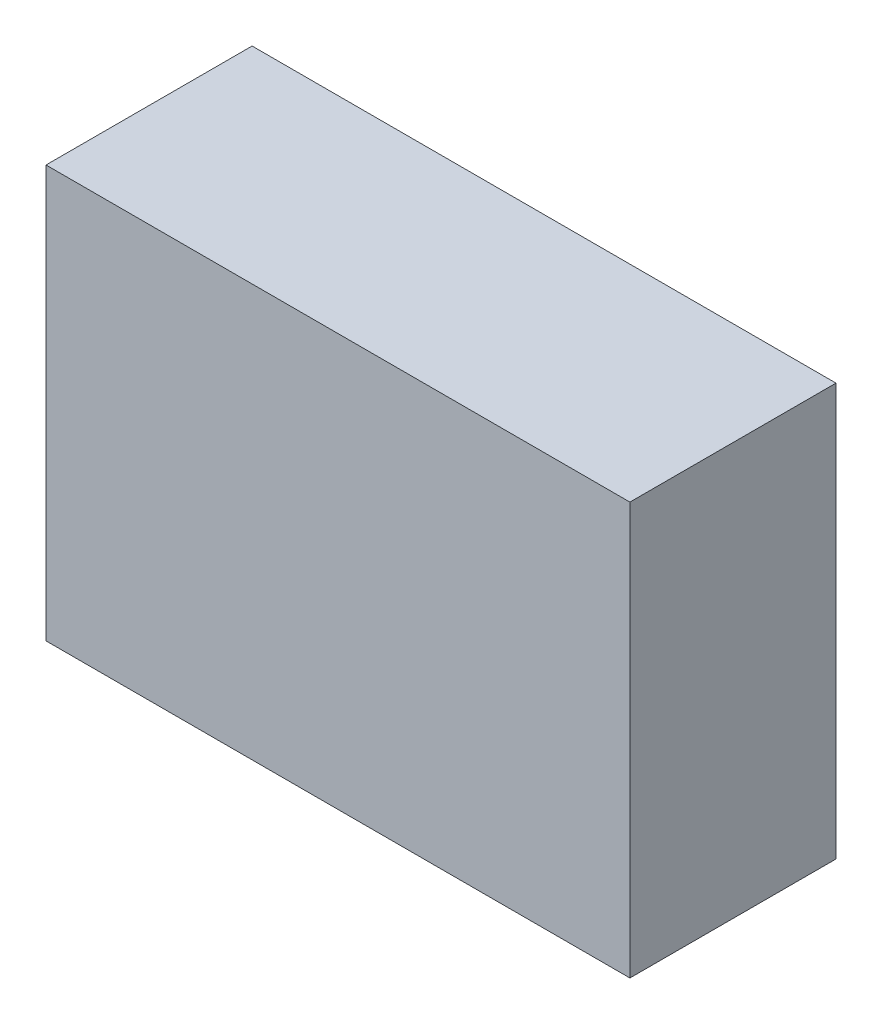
ISO-10303-21;
HEADER;
FILE_DESCRIPTION(('STEP AP214'),'2;1');
FILE_NAME('part.step','',(''),(''),'','','');
FILE_SCHEMA(('AUTOMOTIVE_DESIGN { 1 0 10303 214 1 1 1 1 }'));
ENDSEC;
DATA;
#1=APPLICATION_CONTEXT('core data for automotive mechanical design processes');
#2=APPLICATION_PROTOCOL_DEFINITION('international standard','automotive_design',2000,#1);
#3=PRODUCT_CONTEXT('',#1,'mechanical');
#4=PRODUCT('Part','Part','',(#3));
#5=PRODUCT_RELATED_PRODUCT_CATEGORY('part','',(#4));
#6=PRODUCT_DEFINITION_FORMATION('','',#4);
#7=PRODUCT_DEFINITION_CONTEXT('part definition',#1,'design');
#8=PRODUCT_DEFINITION('design','',#6,#7);
#9=PRODUCT_DEFINITION_SHAPE('','',#8);
#10=(LENGTH_UNIT() NAMED_UNIT(*) SI_UNIT(.MILLI.,.METRE.));
#11=(NAMED_UNIT(*) PLANE_ANGLE_UNIT() SI_UNIT($,.RADIAN.));
#12=(NAMED_UNIT(*) SI_UNIT($,.STERADIAN.) SOLID_ANGLE_UNIT());
#13=UNCERTAINTY_MEASURE_WITH_UNIT(LENGTH_MEASURE(1.E-05),#10,'distance_accuracy_value','');
#14=(GEOMETRIC_REPRESENTATION_CONTEXT(3) GLOBAL_UNCERTAINTY_ASSIGNED_CONTEXT((#13)) GLOBAL_UNIT_ASSIGNED_CONTEXT((#10,
#11,#12)) REPRESENTATION_CONTEXT('',''));
#15=CARTESIAN_POINT('',(0.,0.,0.));
#16=DIRECTION('',(0.,0.,1.));
#17=DIRECTION('',(1.,0.,0.));
#18=AXIS2_PLACEMENT_3D('',#15,#16,#17);
#19=CARTESIAN_POINT('',(-42.5,30.,-30.));
#20=DIRECTION('',(-1.,0.,0.));
#21=DIRECTION('',(0.,0.,1.));
#22=AXIS2_PLACEMENT_3D('',#19,#20,#21);
#23=PLANE('',#22);
#24=DIRECTION('',(0.,-1.,0.));
#25=VECTOR('',#24,1.);
#26=CARTESIAN_POINT('',(-42.5,30.,0.));
#27=LINE('',#26,#25);
#28=CARTESIAN_POINT('',(-42.5,30.,0.));
#29=VERTEX_POINT('',#28);
#30=CARTESIAN_POINT('',(-42.5,-30.,0.));
#31=VERTEX_POINT('',#30);
#32=EDGE_CURVE('E62',#29,#31,#27,.T.);
#33=ORIENTED_EDGE('',*,*,#32,.F.);
#34=DIRECTION('',(0.,0.,1.));
#35=VECTOR('',#34,1.);
#36=CARTESIAN_POINT('',(-42.5,30.,-30.));
#37=LINE('',#36,#35);
#38=CARTESIAN_POINT('',(-42.5,30.,-30.));
#39=VERTEX_POINT('',#38);
#40=EDGE_CURVE('E11',#39,#29,#37,.T.);
#41=ORIENTED_EDGE('',*,*,#40,.F.);
#42=DIRECTION('',(0.,-1.,0.));
#43=VECTOR('',#42,1.);
#44=CARTESIAN_POINT('',(-42.5,30.,-30.));
#45=LINE('',#44,#43);
#46=CARTESIAN_POINT('',(-42.5,-30.,-30.));
#47=VERTEX_POINT('',#46);
#48=EDGE_CURVE('E64',#39,#47,#45,.T.);
#49=ORIENTED_EDGE('',*,*,#48,.T.);
#50=DIRECTION('',(0.,0.,1.));
#51=VECTOR('',#50,1.);
#52=CARTESIAN_POINT('',(-42.5,-30.,-30.));
#53=LINE('',#52,#51);
#54=EDGE_CURVE('E25',#47,#31,#53,.T.);
#55=ORIENTED_EDGE('',*,*,#54,.T.);
#56=EDGE_LOOP('',(#33,#41,#49,#55));
#57=FACE_BOUND('',#56,.T.);
#58=ADVANCED_FACE('F22',(#57),#23,.T.);
#59=CARTESIAN_POINT('',(-42.5,30.,-30.));
#60=DIRECTION('',(0.,1.,0.));
#61=DIRECTION('',(0.,0.,1.));
#62=AXIS2_PLACEMENT_3D('',#59,#60,#61);
#63=PLANE('',#62);
#64=DIRECTION('',(-1.,0.,0.));
#65=VECTOR('',#64,1.);
#66=CARTESIAN_POINT('',(-42.5,30.,0.));
#67=LINE('',#66,#65);
#68=CARTESIAN_POINT('',(42.5,30.,0.));
#69=VERTEX_POINT('',#68);
#70=EDGE_CURVE('E79',#69,#29,#67,.T.);
#71=ORIENTED_EDGE('',*,*,#70,.F.);
#72=DIRECTION('',(0.,0.,1.));
#73=VECTOR('',#72,1.);
#74=CARTESIAN_POINT('',(42.5,30.,-30.));
#75=LINE('',#74,#73);
#76=CARTESIAN_POINT('',(42.5,30.,-30.));
#77=VERTEX_POINT('',#76);
#78=EDGE_CURVE('E30',#77,#69,#75,.T.);
#79=ORIENTED_EDGE('',*,*,#78,.F.);
#80=DIRECTION('',(-1.,0.,0.));
#81=VECTOR('',#80,1.);
#82=CARTESIAN_POINT('',(-42.5,30.,-30.));
#83=LINE('',#82,#81);
#84=EDGE_CURVE('E69',#77,#39,#83,.T.);
#85=ORIENTED_EDGE('',*,*,#84,.T.);
#86=ORIENTED_EDGE('',*,*,#40,.T.);
#87=EDGE_LOOP('',(#71,#79,#85,#86));
#88=FACE_BOUND('',#87,.T.);
#89=ADVANCED_FACE('F94',(#88),#63,.T.);
#90=CARTESIAN_POINT('',(42.5,30.,-30.));
#91=DIRECTION('',(1.,0.,0.));
#92=DIRECTION('',(0.,0.,-1.));
#93=AXIS2_PLACEMENT_3D('',#90,#91,#92);
#94=PLANE('',#93);
#95=DIRECTION('',(0.,1.,0.));
#96=VECTOR('',#95,1.);
#97=CARTESIAN_POINT('',(42.5,30.,0.));
#98=LINE('',#97,#96);
#99=CARTESIAN_POINT('',(42.5,-30.,0.));
#100=VERTEX_POINT('',#99);
#101=EDGE_CURVE('E76',#100,#69,#98,.T.);
#102=ORIENTED_EDGE('',*,*,#101,.F.);
#103=DIRECTION('',(0.,0.,1.));
#104=VECTOR('',#103,1.);
#105=CARTESIAN_POINT('',(42.5,-30.,-30.));
#106=LINE('',#105,#104);
#107=CARTESIAN_POINT('',(42.5,-30.,-30.));
#108=VERTEX_POINT('',#107);
#109=EDGE_CURVE('E68',#108,#100,#106,.T.);
#110=ORIENTED_EDGE('',*,*,#109,.F.);
#111=DIRECTION('',(0.,1.,0.));
#112=VECTOR('',#111,1.);
#113=CARTESIAN_POINT('',(42.5,30.,-30.));
#114=LINE('',#113,#112);
#115=EDGE_CURVE('E87',#108,#77,#114,.T.);
#116=ORIENTED_EDGE('',*,*,#115,.T.);
#117=ORIENTED_EDGE('',*,*,#78,.T.);
#118=EDGE_LOOP('',(#102,#110,#116,#117));
#119=FACE_BOUND('',#118,.T.);
#120=ADVANCED_FACE('F91',(#119),#94,.T.);
#121=CARTESIAN_POINT('',(-42.5,-30.,-30.));
#122=DIRECTION('',(0.,-1.,0.));
#123=DIRECTION('',(0.,0.,-1.));
#124=AXIS2_PLACEMENT_3D('',#121,#122,#123);
#125=PLANE('',#124);
#126=DIRECTION('',(1.,0.,0.));
#127=VECTOR('',#126,1.);
#128=CARTESIAN_POINT('',(-42.5,-30.,0.));
#129=LINE('',#128,#127);
#130=EDGE_CURVE('E71',#31,#100,#129,.T.);
#131=ORIENTED_EDGE('',*,*,#130,.F.);
#132=ORIENTED_EDGE('',*,*,#54,.F.);
#133=DIRECTION('',(1.,0.,0.));
#134=VECTOR('',#133,1.);
#135=CARTESIAN_POINT('',(-42.5,-30.,-30.));
#136=LINE('',#135,#134);
#137=EDGE_CURVE('E85',#47,#108,#136,.T.);
#138=ORIENTED_EDGE('',*,*,#137,.T.);
#139=ORIENTED_EDGE('',*,*,#109,.T.);
#140=EDGE_LOOP('',(#131,#132,#138,#139));
#141=FACE_BOUND('',#140,.T.);
#142=ADVANCED_FACE('F72',(#141),#125,.T.);
#143=CARTESIAN_POINT('',(-42.5,-30.,-30.));
#144=DIRECTION('',(0.,0.,1.));
#145=DIRECTION('',(1.,0.,0.));
#146=AXIS2_PLACEMENT_3D('',#143,#144,#145);
#147=PLANE('',#146);
#148=ORIENTED_EDGE('',*,*,#48,.F.);
#149=ORIENTED_EDGE('',*,*,#84,.F.);
#150=ORIENTED_EDGE('',*,*,#115,.F.);
#151=ORIENTED_EDGE('',*,*,#137,.F.);
#152=EDGE_LOOP('',(#148,#149,#150,#151));
#153=FACE_BOUND('',#152,.T.);
#154=ADVANCED_FACE('F96',(#153),#147,.F.);
#155=CARTESIAN_POINT('',(-42.5,-30.,0.));
#156=DIRECTION('',(0.,0.,1.));
#157=DIRECTION('',(1.,0.,0.));
#158=AXIS2_PLACEMENT_3D('',#155,#156,#157);
#159=PLANE('',#158);
#160=ORIENTED_EDGE('',*,*,#32,.T.);
#161=ORIENTED_EDGE('',*,*,#130,.T.);
#162=ORIENTED_EDGE('',*,*,#101,.T.);
#163=ORIENTED_EDGE('',*,*,#70,.T.);
#164=EDGE_LOOP('',(#160,#161,#162,#163));
#165=FACE_BOUND('',#164,.T.);
#166=ADVANCED_FACE('F78',(#165),#159,.T.);
#167=CLOSED_SHELL('',(#58,#89,#120,#142,#154,#166));
#168=MANIFOLD_SOLID_BREP('B2',#167);
#169=ADVANCED_BREP_SHAPE_REPRESENTATION('',(#18,#168),#14);
#170=SHAPE_DEFINITION_REPRESENTATION(#9,#169);
ENDSEC;
END-ISO-10303-21;
